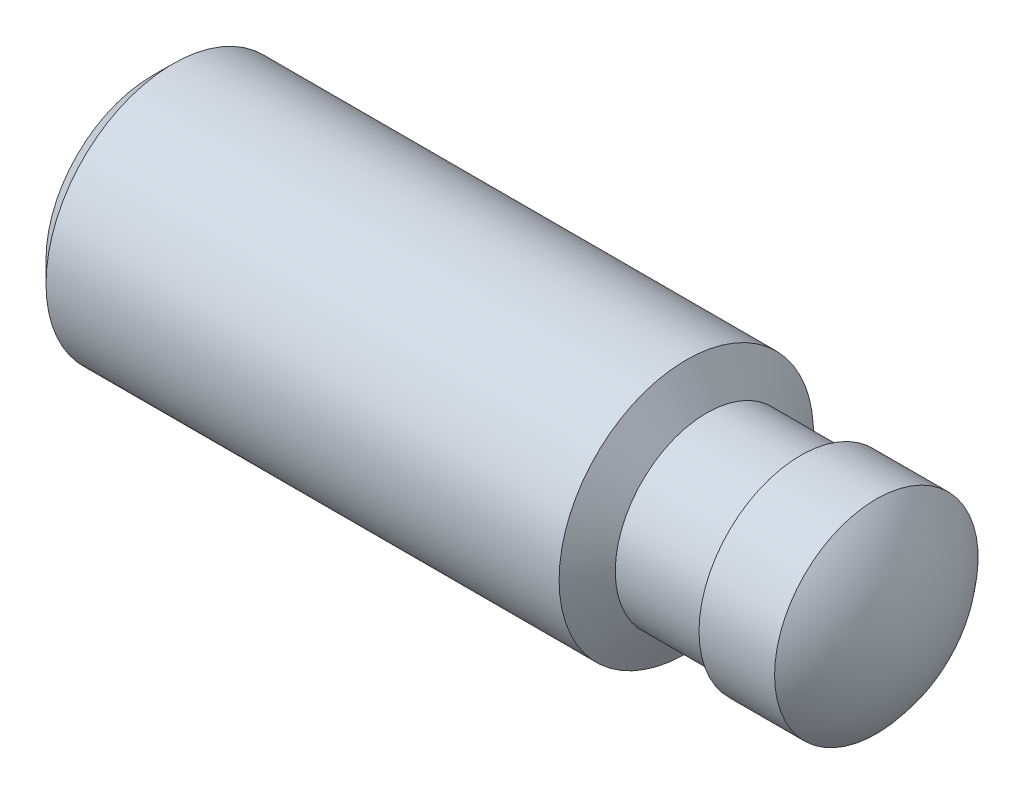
ISO-10303-21;
HEADER;
FILE_DESCRIPTION(('STEP AP214'),'2;1');
FILE_NAME('part.step','',(''),(''),'','','');
FILE_SCHEMA(('AUTOMOTIVE_DESIGN { 1 0 10303 214 1 1 1 1 }'));
ENDSEC;
DATA;
#1=APPLICATION_CONTEXT('core data for automotive mechanical design processes');
#2=APPLICATION_PROTOCOL_DEFINITION('international standard','automotive_design',2000,#1);
#3=PRODUCT_CONTEXT('',#1,'mechanical');
#4=PRODUCT('Part','Part','',(#3));
#5=PRODUCT_RELATED_PRODUCT_CATEGORY('part','',(#4));
#6=PRODUCT_DEFINITION_FORMATION('','',#4);
#7=PRODUCT_DEFINITION_CONTEXT('part definition',#1,'design');
#8=PRODUCT_DEFINITION('design','',#6,#7);
#9=PRODUCT_DEFINITION_SHAPE('','',#8);
#10=(LENGTH_UNIT() NAMED_UNIT(*) SI_UNIT(.MILLI.,.METRE.));
#11=(NAMED_UNIT(*) PLANE_ANGLE_UNIT() SI_UNIT($,.RADIAN.));
#12=(NAMED_UNIT(*) SI_UNIT($,.STERADIAN.) SOLID_ANGLE_UNIT());
#13=UNCERTAINTY_MEASURE_WITH_UNIT(LENGTH_MEASURE(1.E-05),#10,'distance_accuracy_value','');
#14=(GEOMETRIC_REPRESENTATION_CONTEXT(3) GLOBAL_UNCERTAINTY_ASSIGNED_CONTEXT((#13)) GLOBAL_UNIT_ASSIGNED_CONTEXT((#10,
#11,#12)) REPRESENTATION_CONTEXT('',''));
#15=CARTESIAN_POINT('',(0.,0.,0.));
#16=DIRECTION('',(0.,0.,1.));
#17=DIRECTION('',(1.,0.,0.));
#18=AXIS2_PLACEMENT_3D('',#15,#16,#17);
#19=CARTESIAN_POINT('',(0.,0.,0.));
#20=DIRECTION('',(-1.,0.,0.));
#21=DIRECTION('',(0.,0.,1.));
#22=AXIS2_PLACEMENT_3D('',#19,#20,#21);
#23=PLANE('',#22);
#24=CARTESIAN_POINT('',(0.,0.,0.));
#25=DIRECTION('',(-1.,0.,0.));
#26=DIRECTION('',(0.,0.,1.));
#27=AXIS2_PLACEMENT_3D('',#24,#25,#26);
#28=CIRCLE('',#27,4.172);
#29=CARTESIAN_POINT('',(0.,0.,4.172));
#30=VERTEX_POINT('',#29);
#31=EDGE_CURVE('E10',#30,#30,#28,.T.);
#32=ORIENTED_EDGE('',*,*,#31,.T.);
#33=EDGE_LOOP('',(#32));
#34=FACE_BOUND('',#33,.T.);
#35=ADVANCED_FACE('F31',(#34),#23,.T.);
#36=CARTESIAN_POINT('',(0.,0.,0.));
#37=DIRECTION('',(1.,0.,0.));
#38=DIRECTION('',(0.,0.,-1.));
#39=AXIS2_PLACEMENT_3D('',#36,#37,#38);
#40=CONICAL_SURFACE('',#39,4.172,0.78539816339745);
#41=CARTESIAN_POINT('',(0.827999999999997,0.,0.));
#42=DIRECTION('',(-1.,0.,0.));
#43=DIRECTION('',(0.,0.,1.));
#44=AXIS2_PLACEMENT_3D('',#41,#42,#43);
#45=CIRCLE('',#44,5.);
#46=CARTESIAN_POINT('',(0.827999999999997,0.,5.));
#47=VERTEX_POINT('',#46);
#48=EDGE_CURVE('E37',#47,#47,#45,.T.);
#49=ORIENTED_EDGE('',*,*,#48,.T.);
#50=EDGE_LOOP('',(#49));
#51=FACE_BOUND('',#50,.T.);
#52=ORIENTED_EDGE('',*,*,#31,.F.);
#53=EDGE_LOOP('',(#52));
#54=FACE_BOUND('',#53,.T.);
#55=ADVANCED_FACE('F72',(#51,#54),#40,.T.);
#56=CARTESIAN_POINT('',(-3.175,0.,0.));
#57=DIRECTION('',(-1.,0.,0.));
#58=DIRECTION('',(0.,0.,1.));
#59=AXIS2_PLACEMENT_3D('',#56,#57,#58);
#60=CYLINDRICAL_SURFACE('',#59,5.);
#61=CARTESIAN_POINT('',(21.,0.,0.));
#62=DIRECTION('',(-1.,0.,0.));
#63=DIRECTION('',(0.,0.,1.));
#64=AXIS2_PLACEMENT_3D('',#61,#62,#63);
#65=CIRCLE('',#64,5.);
#66=CARTESIAN_POINT('',(21.,0.,5.));
#67=VERTEX_POINT('',#66);
#68=EDGE_CURVE('E41',#67,#67,#65,.T.);
#69=ORIENTED_EDGE('',*,*,#68,.T.);
#70=EDGE_LOOP('',(#69));
#71=FACE_BOUND('',#70,.T.);
#72=ORIENTED_EDGE('',*,*,#48,.F.);
#73=EDGE_LOOP('',(#72));
#74=FACE_BOUND('',#73,.T.);
#75=ADVANCED_FACE('F76',(#71,#74),#60,.T.);
#76=CARTESIAN_POINT('',(21.8082903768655,0.,0.));
#77=DIRECTION('',(-1.,0.,0.));
#78=DIRECTION('',(0.,0.,1.));
#79=AXIS2_PLACEMENT_3D('',#76,#77,#78);
#80=CONICAL_SURFACE('',#79,3.6,1.04719755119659);
#81=ORIENTED_EDGE('',*,*,#68,.F.);
#82=EDGE_LOOP('',(#81));
#83=FACE_BOUND('',#82,.T.);
#84=CARTESIAN_POINT('',(21.8082903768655,0.,0.));
#85=DIRECTION('',(-1.,0.,0.));
#86=DIRECTION('',(0.,0.,1.));
#87=AXIS2_PLACEMENT_3D('',#84,#85,#86);
#88=CIRCLE('',#87,3.6);
#89=CARTESIAN_POINT('',(21.8082903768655,0.,3.6));
#90=VERTEX_POINT('',#89);
#91=EDGE_CURVE('E45',#90,#90,#88,.T.);
#92=ORIENTED_EDGE('',*,*,#91,.T.);
#93=EDGE_LOOP('',(#92));
#94=FACE_BOUND('',#93,.T.);
#95=ADVANCED_FACE('F80',(#83,#94),#80,.T.);
#96=CARTESIAN_POINT('',(-3.175,0.,0.));
#97=DIRECTION('',(-1.,0.,0.));
#98=DIRECTION('',(0.,0.,1.));
#99=AXIS2_PLACEMENT_3D('',#96,#97,#98);
#100=CYLINDRICAL_SURFACE('',#99,3.6);
#101=CARTESIAN_POINT('',(25.5,0.,0.));
#102=DIRECTION('',(-1.,0.,0.));
#103=DIRECTION('',(0.,0.,1.));
#104=AXIS2_PLACEMENT_3D('',#101,#102,#103);
#105=CIRCLE('',#104,3.6);
#106=CARTESIAN_POINT('',(25.5,0.,3.6));
#107=VERTEX_POINT('',#106);
#108=EDGE_CURVE('E50',#107,#107,#105,.T.);
#109=ORIENTED_EDGE('',*,*,#108,.T.);
#110=EDGE_LOOP('',(#109));
#111=FACE_BOUND('',#110,.T.);
#112=ORIENTED_EDGE('',*,*,#91,.F.);
#113=EDGE_LOOP('',(#112));
#114=FACE_BOUND('',#113,.T.);
#115=ADVANCED_FACE('F87',(#111,#114),#100,.T.);
#116=CARTESIAN_POINT('',(25.5,3.6,0.));
#117=DIRECTION('',(-1.,0.,0.));
#118=DIRECTION('',(0.,0.,1.));
#119=AXIS2_PLACEMENT_3D('',#116,#117,#118);
#120=PLANE('',#119);
#121=CARTESIAN_POINT('',(25.5,0.,0.));
#122=DIRECTION('',(-1.,0.,0.));
#123=DIRECTION('',(0.,0.,1.));
#124=AXIS2_PLACEMENT_3D('',#121,#122,#123);
#125=CIRCLE('',#124,4.);
#126=CARTESIAN_POINT('',(25.5,0.,4.));
#127=VERTEX_POINT('',#126);
#128=EDGE_CURVE('E53',#127,#127,#125,.T.);
#129=ORIENTED_EDGE('',*,*,#128,.T.);
#130=EDGE_LOOP('',(#129));
#131=FACE_BOUND('',#130,.T.);
#132=ORIENTED_EDGE('',*,*,#108,.F.);
#133=EDGE_LOOP('',(#132));
#134=FACE_BOUND('',#133,.T.);
#135=ADVANCED_FACE('F69',(#131,#134),#120,.T.);
#136=CARTESIAN_POINT('',(-3.175,0.,0.));
#137=DIRECTION('',(-1.,0.,0.));
#138=DIRECTION('',(0.,0.,1.));
#139=AXIS2_PLACEMENT_3D('',#136,#137,#138);
#140=CYLINDRICAL_SURFACE('',#139,4.);
#141=CARTESIAN_POINT('',(28.4721359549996,0.,0.));
#142=DIRECTION('',(-1.,0.,0.));
#143=DIRECTION('',(0.,0.,1.));
#144=AXIS2_PLACEMENT_3D('',#141,#142,#143);
#145=CIRCLE('',#144,4.);
#146=CARTESIAN_POINT('',(28.4721359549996,0.,4.));
#147=VERTEX_POINT('',#146);
#148=EDGE_CURVE('E56',#147,#147,#145,.T.);
#149=ORIENTED_EDGE('',*,*,#148,.T.);
#150=EDGE_LOOP('',(#149));
#151=FACE_BOUND('',#150,.T.);
#152=ORIENTED_EDGE('',*,*,#128,.F.);
#153=EDGE_LOOP('',(#152));
#154=FACE_BOUND('',#153,.T.);
#155=ADVANCED_FACE('F60',(#151,#154),#140,.T.);
#156=CARTESIAN_POINT('',(24.,0.,0.));
#157=DIRECTION('',(-1.,0.,0.));
#158=DIRECTION('',(0.,1.,0.));
#159=AXIS2_PLACEMENT_3D('',#156,#157,#158);
#160=SPHERICAL_SURFACE('',#159,6.);
#161=ORIENTED_EDGE('',*,*,#148,.F.);
#162=EDGE_LOOP('',(#161));
#163=FACE_BOUND('',#162,.T.);
#164=ADVANCED_FACE('F63',(#163),#160,.T.);
#165=CLOSED_SHELL('',(#35,#55,#75,#95,#115,#135,#155,#164));
#166=MANIFOLD_SOLID_BREP('B2',#165);
#167=ADVANCED_BREP_SHAPE_REPRESENTATION('',(#18,#166),#14);
#168=SHAPE_DEFINITION_REPRESENTATION(#9,#167);
ENDSEC;
END-ISO-10303-21;
